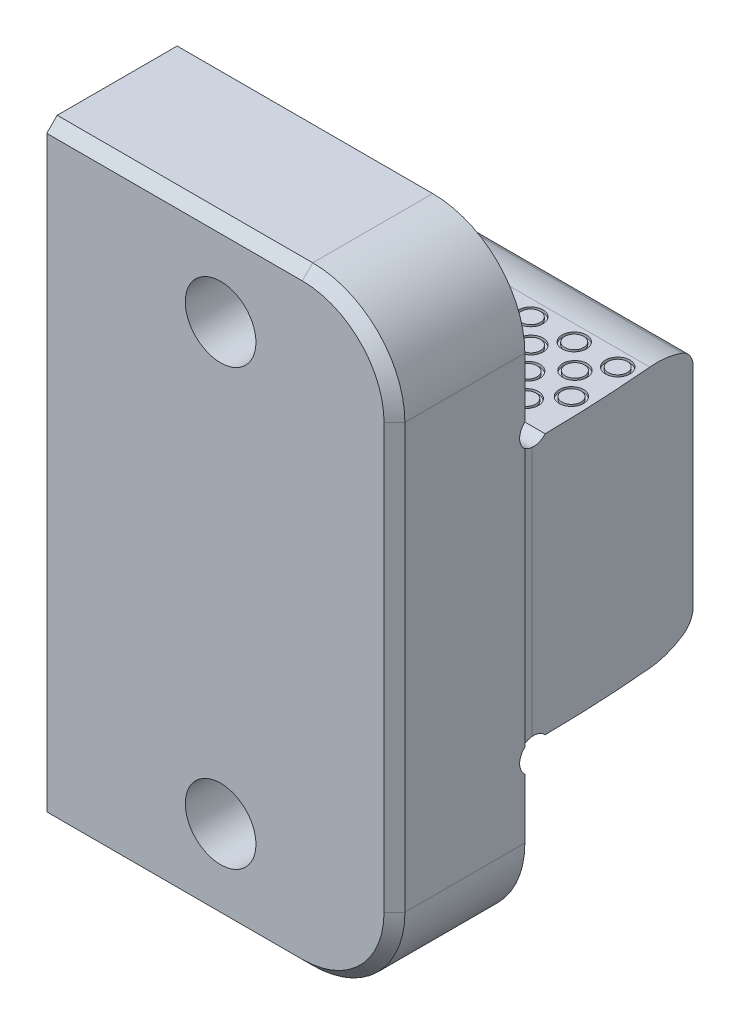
from build123d import *

# Parameters (mm, degrees)
EXTRUDE1_DEPTH             = 25.4
SKETCH7_W                  = 50.8
SKETCH7_H                  = 50.8
CUT_EXTRUDE3_DEPTH         = 0.254
SKETCH8_R                  = 2.286
CUT_EXTRUDE4_DEPTH         = 73.486188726
CUT_EXTRUDE5_DEPTH         = 73.486188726
CUT_EXTRUDE6_DEPTH         = 97.157033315
SKETCH15_R                 = 1.778
SKETCH15_R_2               = 1.397
CUT_EXTRUDE7_DEPTH         = 0.381
F_3_8_16_CBORE_D           = 10.31748
F_3_8_16_CBORE_CBORE_D     = 15.875
F_3_8_16_CBORE_CBORE_DEPTH = 10.31875
FILLET1_R                  = 13.462
CHAMFER1_SIZE              = 1.524


with BuildPart() as part:
    # Sketch3 → Extrude1 (new, symmetric)
    with BuildSketch(Plane(origin=(0, 0, 0), x_dir=(0, 0, -1), z_dir=(1, 0, 0))):
        Polygon((-19.05, -44.45), (0, -44.45), (0, -19.04746), (26.416, -19.04746), (26.416, 19.04746), (0, 19.04746), (0, 44.45), (-19.05, 44.45), align=None)
    extrude(amount=EXTRUDE1_DEPTH, both=True)

    # Sketch7 → Cut-Extrude3 (cut)
    with BuildSketch(Plane(origin=(25.4, 0, 0), x_dir=(0, 0, -1), z_dir=(1, 0, 0))):
        with Locations((25.4, 0)):
            Rectangle(SKETCH7_W, SKETCH7_H)
    extrude(amount=-CUT_EXTRUDE3_DEPTH, mode=Mode.SUBTRACT)

    # Sketch8 → Cut-Extrude4 (cut, through all)
    with BuildSketch(Plane(origin=(25.4, 0, 0), x_dir=(0, 0, -1), z_dir=(1, 0, 0))):
        with Locations((1.524, 20.57146)):
            Circle(SKETCH8_R)
        with Locations((1.524, -20.57146)):
            Circle(SKETCH8_R)
    extrude(amount=-CUT_EXTRUDE4_DEPTH, mode=Mode.SUBTRACT)

    # Sketch9 → Cut-Extrude5 (cut, through all)
    with BuildSketch(Plane(origin=(25.4, 0, 0), x_dir=(0, 0, -1), z_dir=(1, 0, 0))):
        with BuildLine():
            Line((26.416, 15.102173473), (32.004, 15.102173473))
            Line((32.004, 15.102173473), (32.004, 21.452173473))
            Line((32.004, 21.452173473), (19.304, 21.452173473))
            Line((19.304, 21.452173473), (19.304, 19.04746))
            ThreePointArc((19.304, 19.04746), (22.042076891, 18.748787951), (24.651368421, 17.866819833))
            ThreePointArc((24.651368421, 17.866819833), (25.937242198, 16.742081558), (26.416, 15.102173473))
        make_face()
        with BuildLine():
            Line((32.004, -15.102173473), (32.004, -21.452173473))
            Line((32.004, -21.452173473), (19.304, -21.452173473))
            Line((19.304, -21.452173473), (19.304, -19.04746))
            ThreePointArc((19.304, -19.04746), (22.042076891, -18.748787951), (24.651368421, -17.866819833))
            ThreePointArc((24.651368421, -17.866819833), (25.937242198, -16.742081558), (26.416, -15.102173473))
            Line((26.416, -15.102173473), (32.004, -15.102173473))
        make_face()
    extrude(amount=-CUT_EXTRUDE5_DEPTH, mode=Mode.SUBTRACT)

    # Sketch13 → Cut-Extrude6 (cut, through all)
    with BuildSketch(Plane(origin=(0, 44.45, 0), x_dir=(1, 0, 0), z_dir=(0, 1, 0))):
        with BuildLine():
            Line((22.650203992, 33.02), (35.350203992, 33.02))
            Line((35.350203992, 33.02), (35.350203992, 1.27))
            Line((35.350203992, 1.27), (25.146, 1.27))
            ThreePointArc((25.146, 1.27), (24.521090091, 17.193971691), (22.650203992, 33.02))
        make_face()
    extrude(amount=-CUT_EXTRUDE6_DEPTH, mode=Mode.SUBTRACT)

    # Sketch15 → Cut-Extrude7 (cut)
    # profile 1 of 30: a face of its own
    with BuildSketch(Plane(origin=(0, 19.04746, 0), x_dir=(1, 0, 0), z_dir=(0, 1, 0))):
        with Locations(Location((-16.1036, 16.9672, 0), (0, 0, 270))):
            Circle(SKETCH15_R)
        with Locations(Location((-16.1036, 16.9672, 0), (0, 0, 270))):
            Circle(SKETCH15_R_2, mode=Mode.SUBTRACT)
    # profile 2 of 30: a face of its own
    with BuildSketch(Plane(origin=(0, 19.04746, 0), x_dir=(1, 0, 0), z_dir=(0, 1, 0))):
        with Locations(Location((-9.7536, 16.9672, 0), (0, 0, 270))):
            Circle(SKETCH15_R)
        with Locations(Location((-9.7536, 16.9672, 0), (0, 0, 270))):
            Circle(SKETCH15_R_2, mode=Mode.SUBTRACT)
    # profile 3 of 30: a face of its own
    with BuildSketch(Plane(origin=(0, 19.04746, 0), x_dir=(1, 0, 0), z_dir=(0, 1, 0))):
        with Locations(Location((-22.4536, 16.9672, 0), (0, 0, 270))):
            Circle(SKETCH15_R)
        with Locations(Location((-22.4536, 16.9672, 0), (0, 0, 270))):
            Circle(SKETCH15_R_2, mode=Mode.SUBTRACT)
    # profile 4 of 30: a face of its own
    with BuildSketch(Plane(origin=(0, 19.04746, 0), x_dir=(1, 0, 0), z_dir=(0, 1, 0))):
        with Locations(Location((-3.4036, 16.9672, 0), (0, 0, 270))):
            Circle(SKETCH15_R)
        with Locations(Location((-3.4036, 16.9672, 0), (0, 0, 270))):
            Circle(SKETCH15_R_2, mode=Mode.SUBTRACT)
    # profile 5 of 30: a face of its own
    with BuildSketch(Plane(origin=(0, 19.04746, 0), x_dir=(1, 0, 0), z_dir=(0, 1, 0))):
        with Locations(Location((2.9464, 16.9672, 0), (0, 0, 270))):
            Circle(SKETCH15_R)
        with Locations(Location((2.9464, 16.9672, 0), (0, 0, 270))):
            Circle(SKETCH15_R_2, mode=Mode.SUBTRACT)
    # profile 6 of 30: a face of its own
    with BuildSketch(Plane(origin=(0, 19.04746, 0), x_dir=(1, 0, 0), z_dir=(0, 1, 0))):
        with Locations(Location((9.2964, 16.9672, 0), (0, 0, 270))):
            Circle(SKETCH15_R)
        with Locations(Location((9.2964, 16.9672, 0), (0, 0, 270))):
            Circle(SKETCH15_R_2, mode=Mode.SUBTRACT)
    # profile 7 of 30: a face of its own
    with BuildSketch(Plane(origin=(0, 19.04746, 0), x_dir=(1, 0, 0), z_dir=(0, 1, 0))):
        with Locations(Location((15.6464, 16.9672, 0), (0, 0, 270))):
            Circle(SKETCH15_R)
        with Locations(Location((15.6464, 16.9672, 0), (0, 0, 270))):
            Circle(SKETCH15_R_2, mode=Mode.SUBTRACT)
    # profile 8 of 30: a face of its own
    with BuildSketch(Plane(origin=(0, 19.04746, 0), x_dir=(1, 0, 0), z_dir=(0, 1, 0))):
        with Locations(Location((21.9964, 16.9672, 0), (0, 0, 270))):
            Circle(SKETCH15_R)
        with Locations(Location((21.9964, 16.9672, 0), (0, 0, 270))):
            Circle(SKETCH15_R_2, mode=Mode.SUBTRACT)
    # profile 9 of 30: a face of its own
    with BuildSketch(Plane(origin=(0, 19.04746, 0), x_dir=(1, 0, 0), z_dir=(0, 1, 0))):
        with Locations(Location((-12.827, 13.4112, 0), (0, 0, 270))):
            Circle(SKETCH15_R)
        with Locations(Location((-12.827, 13.4112, 0), (0, 0, 270))):
            Circle(SKETCH15_R_2, mode=Mode.SUBTRACT)
    # profile 10 of 30: a face of its own
    with BuildSketch(Plane(origin=(0, 19.04746, 0), x_dir=(1, 0, 0), z_dir=(0, 1, 0))):
        with Locations(Location((-6.4008, 13.4112, 0), (0, 0, 270))):
            Circle(SKETCH15_R)
        with Locations(Location((-6.4008, 13.4112, 0), (0, 0, 270))):
            Circle(SKETCH15_R_2, mode=Mode.SUBTRACT)
    # profile 11 of 30: a face of its own
    with BuildSketch(Plane(origin=(0, 19.04746, 0), x_dir=(1, 0, 0), z_dir=(0, 1, 0))):
        with Locations(Location((-19.2532, 13.4112, 0), (0, 0, 270))):
            Circle(SKETCH15_R)
        with Locations(Location((-19.2532, 13.4112, 0), (0, 0, 270))):
            Circle(SKETCH15_R_2, mode=Mode.SUBTRACT)
    # profile 12 of 30: a face of its own
    with BuildSketch(Plane(origin=(0, 19.04746, 0), x_dir=(1, 0, 0), z_dir=(0, 1, 0))):
        with Locations(Location((0.0254, 13.4112, 0), (0, 0, 270))):
            Circle(SKETCH15_R)
        with Locations(Location((0.0254, 13.4112, 0), (0, 0, 270))):
            Circle(SKETCH15_R_2, mode=Mode.SUBTRACT)
    # profile 13 of 30: a face of its own
    with BuildSketch(Plane(origin=(0, 19.04746, 0), x_dir=(1, 0, 0), z_dir=(0, 1, 0))):
        with Locations(Location((6.4516, 13.4112, 0), (0, 0, 270))):
            Circle(SKETCH15_R)
        with Locations(Location((6.4516, 13.4112, 0), (0, 0, 270))):
            Circle(SKETCH15_R_2, mode=Mode.SUBTRACT)
    # profile 14 of 30: a face of its own
    with BuildSketch(Plane(origin=(0, 19.04746, 0), x_dir=(1, 0, 0), z_dir=(0, 1, 0))):
        with Locations(Location((12.8778, 13.4112, 0), (0, 0, 270))):
            Circle(SKETCH15_R)
        with Locations(Location((12.8778, 13.4112, 0), (0, 0, 270))):
            Circle(SKETCH15_R_2, mode=Mode.SUBTRACT)
    # profile 15 of 30: a face of its own
    with BuildSketch(Plane(origin=(0, 19.04746, 0), x_dir=(1, 0, 0), z_dir=(0, 1, 0))):
        with Locations(Location((19.304, 13.4112, 0), (0, 0, 270))):
            Circle(SKETCH15_R)
        with Locations(Location((19.304, 13.4112, 0), (0, 0, 270))):
            Circle(SKETCH15_R_2, mode=Mode.SUBTRACT)
    # profile 16 of 30: a face of its own
    with BuildSketch(Plane(origin=(0, 19.04746, 0), x_dir=(1, 0, 0), z_dir=(0, 1, 0))):
        with Locations(Location((-16.0528, 9.8552, 0), (0, 0, 270))):
            Circle(SKETCH15_R)
        with Locations(Location((-16.0528, 9.8552, 0), (0, 0, 270))):
            Circle(SKETCH15_R_2, mode=Mode.SUBTRACT)
    # profile 17 of 30: a face of its own
    with BuildSketch(Plane(origin=(0, 19.04746, 0), x_dir=(1, 0, 0), z_dir=(0, 1, 0))):
        with Locations(Location((-9.652, 9.8552, 0), (0, 0, 270))):
            Circle(SKETCH15_R)
        with Locations(Location((-9.652, 9.8552, 0), (0, 0, 270))):
            Circle(SKETCH15_R_2, mode=Mode.SUBTRACT)
    # profile 18 of 30: a face of its own
    with BuildSketch(Plane(origin=(0, 19.04746, 0), x_dir=(1, 0, 0), z_dir=(0, 1, 0))):
        with Locations(Location((-22.4536, 9.8552, 0), (0, 0, 270))):
            Circle(SKETCH15_R)
        with Locations(Location((-22.4536, 9.8552, 0), (0, 0, 270))):
            Circle(SKETCH15_R_2, mode=Mode.SUBTRACT)
    # profile 19 of 30: a face of its own
    with BuildSketch(Plane(origin=(0, 19.04746, 0), x_dir=(1, 0, 0), z_dir=(0, 1, 0))):
        with Locations(Location((-3.2512, 9.8552, 0), (0, 0, 270))):
            Circle(SKETCH15_R)
        with Locations(Location((-3.2512, 9.8552, 0), (0, 0, 270))):
            Circle(SKETCH15_R_2, mode=Mode.SUBTRACT)
    # profile 20 of 30: a face of its own
    with BuildSketch(Plane(origin=(0, 19.04746, 0), x_dir=(1, 0, 0), z_dir=(0, 1, 0))):
        with Locations(Location((3.1496, 9.8552, 0), (0, 0, 270))):
            Circle(SKETCH15_R)
        with Locations(Location((3.1496, 9.8552, 0), (0, 0, 270))):
            Circle(SKETCH15_R_2, mode=Mode.SUBTRACT)
    # profile 21 of 30: a face of its own
    with BuildSketch(Plane(origin=(0, 19.04746, 0), x_dir=(1, 0, 0), z_dir=(0, 1, 0))):
        with Locations(Location((9.5504, 9.8552, 0), (0, 0, 270))):
            Circle(SKETCH15_R)
        with Locations(Location((9.5504, 9.8552, 0), (0, 0, 270))):
            Circle(SKETCH15_R_2, mode=Mode.SUBTRACT)
    # profile 22 of 30: a face of its own
    with BuildSketch(Plane(origin=(0, 19.04746, 0), x_dir=(1, 0, 0), z_dir=(0, 1, 0))):
        with Locations(Location((15.9512, 9.8552, 0), (0, 0, 270))):
            Circle(SKETCH15_R)
        with Locations(Location((15.9512, 9.8552, 0), (0, 0, 270))):
            Circle(SKETCH15_R_2, mode=Mode.SUBTRACT)
    # profile 23 of 30: a face of its own
    with BuildSketch(Plane(origin=(0, 19.04746, 0), x_dir=(1, 0, 0), z_dir=(0, 1, 0))):
        with Locations(Location((22.352, 9.8552, 0), (0, 0, 270))):
            Circle(SKETCH15_R)
        with Locations(Location((22.352, 9.8552, 0), (0, 0, 270))):
            Circle(SKETCH15_R_2, mode=Mode.SUBTRACT)
    # profile 24 of 30: a face of its own
    with BuildSketch(Plane(origin=(0, 19.04746, 0), x_dir=(1, 0, 0), z_dir=(0, 1, 0))):
        with Locations(Location((-12.827, 6.2992, 0), (0, 0, 270))):
            Circle(SKETCH15_R)
        with Locations(Location((-12.827, 6.2992, 0), (0, 0, 270))):
            Circle(SKETCH15_R_2, mode=Mode.SUBTRACT)
    # profile 25 of 30: a face of its own
    with BuildSketch(Plane(origin=(0, 19.04746, 0), x_dir=(1, 0, 0), z_dir=(0, 1, 0))):
        with Locations(Location((-6.4008, 6.2992, 0), (0, 0, 270))):
            Circle(SKETCH15_R)
        with Locations(Location((-6.4008, 6.2992, 0), (0, 0, 270))):
            Circle(SKETCH15_R_2, mode=Mode.SUBTRACT)
    # profile 26 of 30: a face of its own
    with BuildSketch(Plane(origin=(0, 19.04746, 0), x_dir=(1, 0, 0), z_dir=(0, 1, 0))):
        with Locations(Location((-19.2532, 6.2992, 0), (0, 0, 270))):
            Circle(SKETCH15_R)
        with Locations(Location((-19.2532, 6.2992, 0), (0, 0, 270))):
            Circle(SKETCH15_R_2, mode=Mode.SUBTRACT)
    # profile 27 of 30: a face of its own
    with BuildSketch(Plane(origin=(0, 19.04746, 0), x_dir=(1, 0, 0), z_dir=(0, 1, 0))):
        with Locations(Location((0.0254, 6.2992, 0), (0, 0, 270))):
            Circle(SKETCH15_R)
        with Locations(Location((0.0254, 6.2992, 0), (0, 0, 270))):
            Circle(SKETCH15_R_2, mode=Mode.SUBTRACT)
    # profile 28 of 30: a face of its own
    with BuildSketch(Plane(origin=(0, 19.04746, 0), x_dir=(1, 0, 0), z_dir=(0, 1, 0))):
        with Locations(Location((6.4516, 6.2992, 0), (0, 0, 270))):
            Circle(SKETCH15_R)
        with Locations(Location((6.4516, 6.2992, 0), (0, 0, 270))):
            Circle(SKETCH15_R_2, mode=Mode.SUBTRACT)
    # profile 29 of 30: a face of its own
    with BuildSketch(Plane(origin=(0, 19.04746, 0), x_dir=(1, 0, 0), z_dir=(0, 1, 0))):
        with Locations(Location((12.8778, 6.2992, 0), (0, 0, 270))):
            Circle(SKETCH15_R)
        with Locations(Location((12.8778, 6.2992, 0), (0, 0, 270))):
            Circle(SKETCH15_R_2, mode=Mode.SUBTRACT)
    # profile 30 of 30: a face of its own
    with BuildSketch(Plane(origin=(0, 19.04746, 0), x_dir=(1, 0, 0), z_dir=(0, 1, 0))):
        with Locations(Location((19.304, 6.2992, 0), (0, 0, 270))):
            Circle(SKETCH15_R)
        with Locations(Location((19.304, 6.2992, 0), (0, 0, 270))):
            Circle(SKETCH15_R_2, mode=Mode.SUBTRACT)
    cut_extrude7 = extrude(amount=-CUT_EXTRUDE7_DEPTH, mode=Mode.SUBTRACT)

    # Mirror1: Cut-Extrude7 across plane
    add(cut_extrude7.mirror(Plane.ZX), mode=Mode.SUBTRACT)

    # 3_8_-16 CBORE (through all)
    with Locations(Plane(origin=(0, 0, 0), x_dir=(-1, 0, 0), z_dir=(0, 0, -1))):
        with Locations((0, 31.75), (0, -31.75)):
            CounterBoreHole(F_3_8_16_CBORE_D / 2, F_3_8_16_CBORE_CBORE_D / 2, F_3_8_16_CBORE_CBORE_DEPTH)

    # Fillet1
    fillet1_edges = [part.edges().sort_by_distance(p)[0] for p in [
        (25.4, 44.45, 9.525),
        (25.4, -44.45, 9.525),
    ]]
    fillet(fillet1_edges, radius=FILLET1_R)

    # Chamfer1
    chamfer1_edges = [part.edges().sort_by_distance(p)[0] for p in [
        (25.4, 0, 19.05),
        (-6.731, -44.45, 19.05),
        (-6.731, 44.45, 19.05),
        (21.457071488, 40.507071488, 19.05),
        (21.457071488, -40.507071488, 19.05),
    ]]
    chamfer(chamfer1_edges, length=CHAMFER1_SIZE)


solid = part.part
